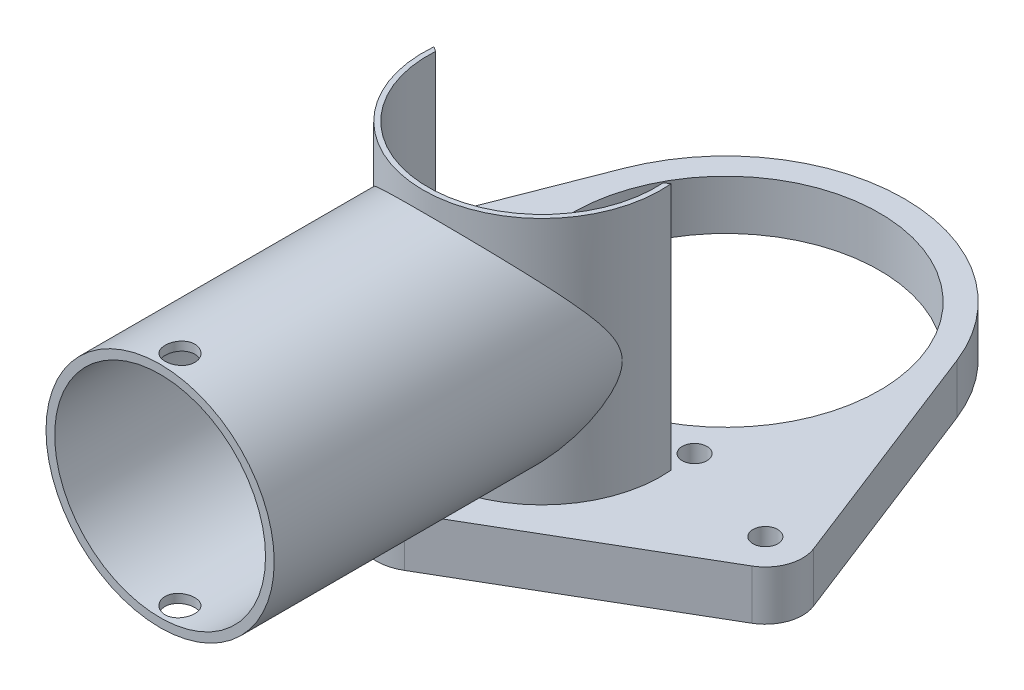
from build123d import *

# Parameters (mm, degrees)
SKETCH_1_R           = 100
EXTRUDE_1_DEPTH      = 10
SKETCH_2_R           = 2.5
CUT_EXTRUDE_1_DEPTH  = 142.774468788
SKETCH_7_R           = 2.5
CUT_EXTRUDE_2_DEPTH  = 10
SKETCH_8_R           = 31
CUT_EXTRUDE_4_DEPTH  = 142.774468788
SKETCH_12_R          = 4
EXTRUDE_5_DEPTH      = 10
EXTRUDE_6_DEPTH      = 50
SKETCH_14_R          = 23
CUT_EXTRUDE_5_DEPTH  = 43
SKETCH_15_R          = 23
EXTRUDE_7_DEPTH      = 77
SKETCH_16_R          = 21.25
CUT_EXTRUDE_6_DEPTH  = 77
CUT_EXTRUDE_7_REACH  = 155.623
SKETCH_17_R          = 23
FILLET_2_R           = 3
SKETCH_18_R          = 3
CUT_EXTRUDE_8_DEPTH  = 47
SKETCH_20_R          = 100
CUT_EXTRUDE_10_DEPTH = 10


with BuildPart() as part:
    # Sketch 1 → Extrude 1 (new body)
    with BuildSketch(Plane(origin=(0, 0, 0), x_dir=(1, 0, 0), z_dir=(0, 1, 0))):
        with Locations(Location((0, 0, 0), (0, 0, 270))):
            Circle(SKETCH_1_R)
    extrude(amount=EXTRUDE_1_DEPTH)

    # Sketch 2 → Cut-Extrude 1 (cut, through all)
    with BuildSketch(Plane(origin=(0, 10, 0), x_dir=(1, 0, 0), z_dir=(0, 1, 0))):
        with Locations(Location((-23.366065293, 7.367292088, 0), (0, 0, 270))):
            Circle(SKETCH_2_R)
        with Locations(Location((23.366065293, 7.367292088, 0), (0, 0, 270))):
            Circle(SKETCH_2_R)
        with Locations(Location((0, -24.5, 0), (0, 0, 270))):
            Circle(SKETCH_2_R)
    extrude(amount=-CUT_EXTRUDE_1_DEPTH, mode=Mode.SUBTRACT)

    # Sketch 7 → Cut-Extrude 2 (cut)
    with BuildSketch(Plane(origin=(0, 10, 0), x_dir=(1, 0, 0), z_dir=(0, 1, 0))):
        with Locations(Location((-45, 0, 0), (0, 0, 270))):
            Circle(SKETCH_7_R)
        with Locations(Location((45, 0, 0), (0, 0, 270))):
            Circle(SKETCH_7_R)
    extrude(amount=-CUT_EXTRUDE_2_DEPTH, mode=Mode.SUBTRACT)

    # Sketch 8 → Cut-Extrude 4 (cut, through all)
    with BuildSketch(Plane(origin=(0, 10, 0), x_dir=(1, 0, 0), z_dir=(0, 1, 0))):
        with Locations(Location((0, 37, 0), (0, 0, 270))):
            Circle(SKETCH_8_R)
    extrude(amount=-CUT_EXTRUDE_4_DEPTH, mode=Mode.SUBTRACT)

    # Sketch 12 → Extrude 5 (add, through all)
    with BuildSketch(Plane(origin=(0, 10, 0), x_dir=(1, 0, 0), z_dir=(0, 1, 0))):
        with Locations((0, -24.5)):
            Circle(SKETCH_12_R)
    extrude(amount=-EXTRUDE_5_DEPTH)

    # Sketch 11 → Extrude 6 (add)
    with BuildSketch(Plane(origin=(0, 10, 0), x_dir=(1, 0, 0), z_dir=(0, 1, 0))):
        with BuildLine():
            ThreePointArc((-21.982884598, 0.867631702), (0, -22), (21.982884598, 0.867631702))
            ThreePointArc((21.982884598, 0.867631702), (22.953356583, 1.476223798), (23.906990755, 2.110874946))
            ThreePointArc((23.906990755, 2.110874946), (0, -24), (-23.906990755, 2.110874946))
            ThreePointArc((-23.906990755, 2.110874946), (-22.953356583, 1.476223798), (-21.982884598, 0.867631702))
        make_face()
    extrude(amount=EXTRUDE_6_DEPTH)

    # Sketch 14 → Cut-Extrude 5 (cut)
    with BuildSketch(Plane.XY):
        with Locations(Location((0, 33.1, 0), (0, 0, 180))):
            Circle(SKETCH_14_R)
    extrude(amount=CUT_EXTRUDE_5_DEPTH, mode=Mode.SUBTRACT)

    # Sketch 15 → Extrude 7 (add)
    with BuildSketch(Plane.XY):
        with Locations(Location((0, 33.1, 0), (0, 0, 180))):
            Circle(SKETCH_15_R)
    extrude(amount=EXTRUDE_7_DEPTH)

    # Sketch 16 → Cut-Extrude 6 (cut)
    with BuildSketch(Plane.XY.offset(77)):
        with Locations((0, 33.1)):
            Circle(SKETCH_16_R)
    extrude(amount=-CUT_EXTRUDE_6_DEPTH, mode=Mode.SUBTRACT)

    # Cut-Extrude 7: up to this face of the body (flat: up to its plane)
    cut_extrude_7_end = Plane(part.part.faces().sort_by_distance((0, 10, 3.900976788))[0])
    # Sketch 17 → Cut-Extrude 7 (cut, up to the picked face)
    with BuildSketch(Plane(origin=(0, 60, 0), x_dir=(1, 0, 0), z_dir=(0, 1, 0)), mode=Mode.PRIVATE) as cut_extrude_7_sk1:
        Circle(SKETCH_17_R)
    cut_extrude_7_tool1 = split(extrude(cut_extrude_7_sk1.sketch, amount=-CUT_EXTRUDE_7_REACH, mode=Mode.PRIVATE), bisect_by=cut_extrude_7_end, keep=Keep.BOTH, mode=Mode.PRIVATE)
    add(cut_extrude_7_tool1.solids().sort_by(Axis((0, 60, 0), (0, -1, 0)))[0], mode=Mode.SUBTRACT)

    # Fillet 2
    fillet_2_edges = [part.edges().sort_by_distance(p)[0] for p in [
        (-21.25, 33.1, 8.799857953),
    ]]
    fillet(fillet_2_edges, radius=FILLET_2_R)

    # Sketch 18 → Cut-Extrude 8 (cut)
    with BuildSketch(Plane(origin=(0, 10, 0), x_dir=(1, 0, 0), z_dir=(0, 1, 0))):
        with Locations(Location((0, -73, 0), (0, 0, 90))):
            Circle(SKETCH_18_R)
    extrude(amount=CUT_EXTRUDE_8_DEPTH, mode=Mode.SUBTRACT)

    # Sketch 20 → Cut-Extrude 10 (cut)
    with BuildSketch(Plane.XZ):
        Circle(SKETCH_20_R)
        with BuildLine():
            Line((-4.533076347, 32.275038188), (-48.777563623, 6.47919849))
            ThreePointArc((-48.777563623, 6.47919849), (-52.081259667, 2.470983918), (-51.988444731, -2.722432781))
            Line((-51.988444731, -2.722432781), (-33.544534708, -50.067677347))
            ThreePointArc((-33.544534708, -50.067677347), (0, -73), (33.544534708, -50.067677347))
            Line((33.544534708, -50.067677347), (51.988444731, -2.722432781))
            ThreePointArc((51.988444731, -2.722432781), (52.081259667, 2.470983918), (48.777563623, 6.47919849))
            Line((48.777563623, 6.47919849), (4.533076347, 32.275038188))
            ThreePointArc((4.533076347, 32.275038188), (0, 33.5), (-4.533076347, 32.275038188))
        make_face(mode=Mode.SUBTRACT)
    extrude(amount=-CUT_EXTRUDE_10_DEPTH, mode=Mode.SUBTRACT)


solid = part.part
